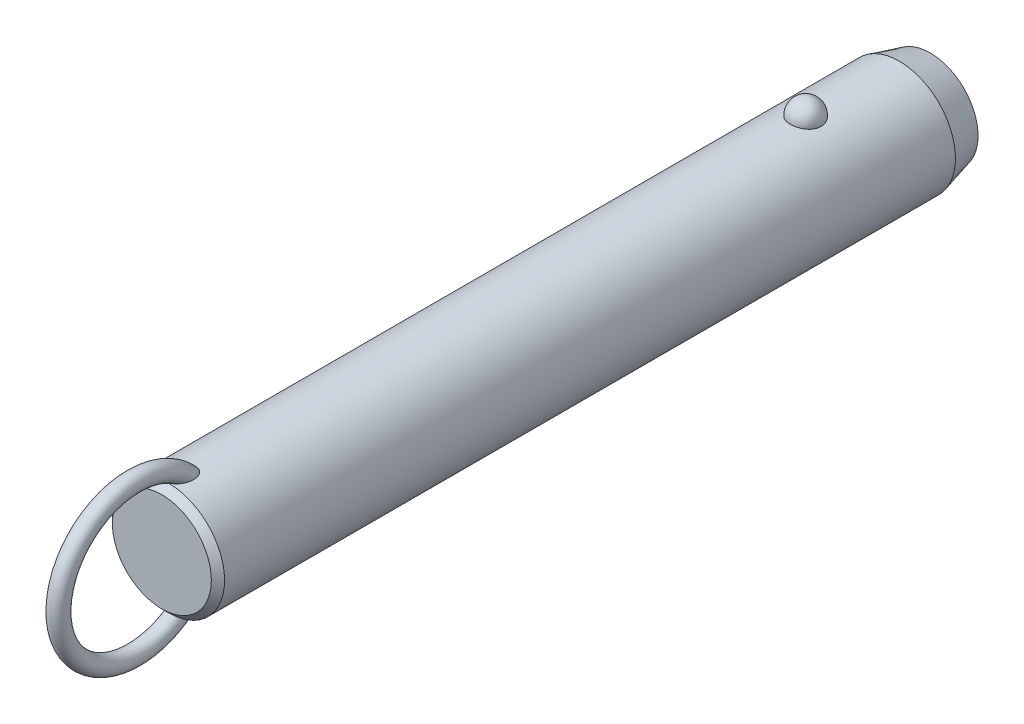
ISO-10303-21;
HEADER;
FILE_DESCRIPTION(('STEP AP214'),'2;1');
FILE_NAME('part.step','',(''),(''),'','','');
FILE_SCHEMA(('AUTOMOTIVE_DESIGN { 1 0 10303 214 1 1 1 1 }'));
ENDSEC;
DATA;
#1=APPLICATION_CONTEXT('core data for automotive mechanical design processes');
#2=APPLICATION_PROTOCOL_DEFINITION('international standard','automotive_design',2000,#1);
#3=PRODUCT_CONTEXT('',#1,'mechanical');
#4=PRODUCT('Part','Part','',(#3));
#5=PRODUCT_RELATED_PRODUCT_CATEGORY('part','',(#4));
#6=PRODUCT_DEFINITION_FORMATION('','',#4);
#7=PRODUCT_DEFINITION_CONTEXT('part definition',#1,'design');
#8=PRODUCT_DEFINITION('design','',#6,#7);
#9=PRODUCT_DEFINITION_SHAPE('','',#8);
#10=(LENGTH_UNIT() NAMED_UNIT(*) SI_UNIT(.MILLI.,.METRE.));
#11=(NAMED_UNIT(*) PLANE_ANGLE_UNIT() SI_UNIT($,.RADIAN.));
#12=(NAMED_UNIT(*) SI_UNIT($,.STERADIAN.) SOLID_ANGLE_UNIT());
#13=UNCERTAINTY_MEASURE_WITH_UNIT(LENGTH_MEASURE(1.E-05),#10,'distance_accuracy_value','');
#14=(GEOMETRIC_REPRESENTATION_CONTEXT(3) GLOBAL_UNCERTAINTY_ASSIGNED_CONTEXT((#13)) GLOBAL_UNIT_ASSIGNED_CONTEXT((#10,
#11,#12)) REPRESENTATION_CONTEXT('',''));
#15=CARTESIAN_POINT('',(0.,0.,0.));
#16=DIRECTION('',(0.,0.,1.));
#17=DIRECTION('',(1.,0.,0.));
#18=AXIS2_PLACEMENT_3D('',#15,#16,#17);
#19=CARTESIAN_POINT('',(0.,0.,129.5));
#20=DIRECTION('',(0.,0.,-1.));
#21=DIRECTION('',(-1.,0.,0.));
#22=AXIS2_PLACEMENT_3D('',#19,#20,#21);
#23=CYLINDRICAL_SURFACE('',#22,12.7);
#24=CARTESIAN_POINT('',(3.46661256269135,12.2177165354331,-3.5));
#25=CARTESIAN_POINT('',(3.4666090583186,12.2177194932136,-3.30432790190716));
#26=CARTESIAN_POINT('',(3.45063567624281,12.2222841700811,-3.10861112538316));
#27=CARTESIAN_POINT('',(3.38712451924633,12.2400345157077,-2.72271899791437));
#28=CARTESIAN_POINT('',(3.33957415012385,12.2532236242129,-2.53254588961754));
#29=CARTESIAN_POINT('',(3.2141234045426,12.286724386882,-2.16324948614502));
#30=CARTESIAN_POINT('',(3.13623639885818,12.3070329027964,-1.98412136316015));
#31=CARTESIAN_POINT('',(2.95205930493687,12.3525018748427,-1.64180592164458));
#32=CARTESIAN_POINT('',(2.84577003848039,12.3776621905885,-1.47861814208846));
#33=CARTESIAN_POINT('',(2.60688050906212,12.4301712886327,-1.17190583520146));
#34=CARTESIAN_POINT('',(2.47415697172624,12.4575299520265,-1.02847897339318));
#35=CARTESIAN_POINT('',(2.18615174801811,12.5112810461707,-0.766177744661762));
#36=CARTESIAN_POINT('',(2.03087002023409,12.5376734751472,-0.64730342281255));
#37=CARTESIAN_POINT('',(1.70237334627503,12.5864761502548,-0.437732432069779));
#38=CARTESIAN_POINT('',(1.52920948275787,12.6088972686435,-0.346958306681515));
#39=CARTESIAN_POINT('',(1.16944170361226,12.6473352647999,-0.195750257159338));
#40=CARTESIAN_POINT('',(0.982839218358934,12.663352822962,-0.135313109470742));
#41=CARTESIAN_POINT('',(0.604961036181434,12.6869706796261,-0.0473241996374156));
#42=CARTESIAN_POINT('',(0.41382314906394,12.6947125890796,-0.0192185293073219));
#43=CARTESIAN_POINT('',(0.0293827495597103,12.7014203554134,0.0051725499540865));
#44=CARTESIAN_POINT('',(-0.163919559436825,12.7003870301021,0.00146092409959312));
#45=CARTESIAN_POINT('',(-0.544374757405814,12.689735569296,-0.0373939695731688));
#46=CARTESIAN_POINT('',(-0.731575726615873,12.6802364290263,-0.0721015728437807));
#47=CARTESIAN_POINT('',(-1.09733277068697,12.6538333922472,-0.171364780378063));
#48=CARTESIAN_POINT('',(-1.27588869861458,12.6369293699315,-0.235920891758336));
#49=CARTESIAN_POINT('',(-1.6204698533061,12.5973946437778,-0.393548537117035));
#50=CARTESIAN_POINT('',(-1.78641865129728,12.5747321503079,-0.486778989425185));
#51=CARTESIAN_POINT('',(-2.10030671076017,12.5261316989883,-0.699110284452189));
#52=CARTESIAN_POINT('',(-2.24824419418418,12.5001934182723,-0.818213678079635));
#53=CARTESIAN_POINT('',(-2.52491489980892,12.4472906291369,-1.08157124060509));
#54=CARTESIAN_POINT('',(-2.65324222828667,12.4203160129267,-1.22624992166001));
#55=CARTESIAN_POINT('',(-2.88410007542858,12.3687509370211,-1.53528325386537));
#56=CARTESIAN_POINT('',(-2.98662883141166,12.3441606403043,-1.69963924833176));
#57=CARTESIAN_POINT('',(-3.16432417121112,12.2998199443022,-2.04548497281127));
#58=CARTESIAN_POINT('',(-3.23917525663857,12.2801261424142,-2.22714424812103));
#59=CARTESIAN_POINT('',(-3.35800573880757,12.248167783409,-2.6009138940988));
#60=CARTESIAN_POINT('',(-3.4019860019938,12.2359030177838,-2.79302397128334));
#61=CARTESIAN_POINT('',(-3.45784812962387,12.2202347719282,-3.18140279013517));
#62=CARTESIAN_POINT('',(-3.46986123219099,12.2167950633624,-3.37765118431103));
#63=CARTESIAN_POINT('',(-3.46186273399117,12.2190638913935,-3.76943689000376));
#64=CARTESIAN_POINT('',(-3.44185196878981,12.2247721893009,-3.96497421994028));
#65=CARTESIAN_POINT('',(-3.37048652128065,12.2446381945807,-4.34881728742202));
#66=CARTESIAN_POINT('',(-3.31928253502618,12.2587552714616,-4.53715319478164));
#67=CARTESIAN_POINT('',(-3.18693461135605,12.2938237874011,-4.90231727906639));
#68=CARTESIAN_POINT('',(-3.1057895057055,12.3147754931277,-5.07914500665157));
#69=CARTESIAN_POINT('',(-2.91506431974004,12.3613125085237,-5.41732059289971));
#70=CARTESIAN_POINT('',(-2.80533587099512,12.3869217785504,-5.57858147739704));
#71=CARTESIAN_POINT('',(-2.560414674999,12.4398525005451,-5.88013283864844));
#72=CARTESIAN_POINT('',(-2.42522099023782,12.4671740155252,-6.02042254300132));
#73=CARTESIAN_POINT('',(-2.1323357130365,12.5205965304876,-6.27662798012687));
#74=CARTESIAN_POINT('',(-1.97456596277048,12.5466928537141,-6.3924554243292));
#75=CARTESIAN_POINT('',(-1.64115839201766,12.5946384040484,-6.59583547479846));
#76=CARTESIAN_POINT('',(-1.46552179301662,12.6164879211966,-6.68339001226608));
#77=CARTESIAN_POINT('',(-1.10356050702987,12.6532533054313,-6.82682153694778));
#78=CARTESIAN_POINT('',(-0.9173913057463,12.6682500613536,-6.8830698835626));
#79=CARTESIAN_POINT('',(-0.537836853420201,12.6900288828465,-6.96386887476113));
#80=CARTESIAN_POINT('',(-0.344452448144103,12.6968119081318,-6.9884232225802));
#81=CARTESIAN_POINT('',(0.0402577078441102,12.7013667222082,-7.00496469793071));
#82=CARTESIAN_POINT('',(0.231556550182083,12.6993008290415,-6.99753844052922));
#83=CARTESIAN_POINT('',(0.610105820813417,12.6867505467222,-6.9516636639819));
#84=CARTESIAN_POINT('',(0.797356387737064,12.6762664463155,-6.913216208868));
#85=CARTESIAN_POINT('',(1.16186657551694,12.6480587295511,-6.80658431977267));
#86=CARTESIAN_POINT('',(1.33915951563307,12.6303611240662,-6.73850666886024));
#87=CARTESIAN_POINT('',(1.67968518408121,12.5896027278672,-6.5745087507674));
#88=CARTESIAN_POINT('',(1.84291705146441,12.5665416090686,-6.47858678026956));
#89=CARTESIAN_POINT('',(2.15340192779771,12.5171072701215,-6.25982455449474));
#90=CARTESIAN_POINT('',(2.30037831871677,12.4906895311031,-6.13660186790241));
#91=CARTESIAN_POINT('',(2.5717412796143,12.4376567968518,-5.86739587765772));
#92=CARTESIAN_POINT('',(2.69612388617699,12.4110417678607,-5.72140858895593));
#93=CARTESIAN_POINT('',(2.92107785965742,12.360051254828,-5.40794137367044));
#94=CARTESIAN_POINT('',(3.02121329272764,12.3357209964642,-5.24014110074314));
#95=CARTESIAN_POINT('',(3.19236291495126,12.2925446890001,-4.88969865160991));
#96=CARTESIAN_POINT('',(3.26338839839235,12.2736965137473,-4.70706226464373));
#97=CARTESIAN_POINT('',(3.36788038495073,12.245404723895,-4.35469510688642));
#98=CARTESIAN_POINT('',(3.40484026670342,12.2351018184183,-4.18605935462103));
#99=CARTESIAN_POINT('',(3.45420764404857,12.2212564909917,-3.84496058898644));
#100=CARTESIAN_POINT('',(3.46661565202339,12.2177139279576,-3.67249765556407));
#101=CARTESIAN_POINT('',(3.46661256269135,12.2177165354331,-3.5));
#102=B_SPLINE_CURVE_WITH_KNOTS('',3,(#24,#25,#26,#27,#28,#29,#30,#31,#32,#33,#34,#35,#36,#37,
#38,#39,#40,#41,#42,#43,#44,#45,#46,#47,#48,#49,#50,#51,#52,#53,#54,#55,#56,#57,#58,#59,#60,#61,
#62,#63,#64,#65,#66,#67,#68,#69,#70,#71,#72,#73,#74,#75,#76,#77,#78,#79,#80,#81,#82,#83,#84,#85,
#86,#87,#88,#89,#90,#91,#92,#93,#94,#95,#96,#97,#98,#99,#100,#101),.UNSPECIFIED.,.T.,.F.,(4,2,2,
2,2,2,2,2,2,2,2,2,2,2,2,2,2,2,2,2,2,2,2,2,2,2,2,2,2,2,2,2,2,2,2,2,2,2,4),(0.,0.586396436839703,
1.17302689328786,1.7593990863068,2.34575431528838,2.93491084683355,3.52406845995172,
4.11158733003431,4.69904375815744,5.2762784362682,5.85345931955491,6.42265312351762,
6.99185659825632,7.56427334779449,8.136746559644,8.71981013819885,9.3029135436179,
9.89247258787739,10.4820150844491,11.0691335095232,11.6562366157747,12.2405256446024,
12.8248374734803,13.412244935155,13.9996740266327,14.5891883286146,15.1786623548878,
15.7609861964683,16.3432419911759,16.9148635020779,17.4864654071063,18.0560241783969,
18.6256177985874,19.2037609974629,19.7820055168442,20.3699810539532,20.957728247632,
21.4746855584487,21.9916320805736),.UNSPECIFIED.);
#103=CARTESIAN_POINT('',(3.46661256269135,12.2177165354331,-3.5));
#104=VERTEX_POINT('',#103);
#105=EDGE_CURVE('E41',#104,#104,#102,.T.);
#106=ORIENTED_EDGE('',*,*,#105,.T.);
#107=EDGE_LOOP('',(#106));
#108=FACE_BOUND('',#107,.T.);
#109=CARTESIAN_POINT('',(0.,0.,140.7));
#110=DIRECTION('',(0.,0.,1.));
#111=DIRECTION('',(1.,0.,0.));
#112=AXIS2_PLACEMENT_3D('',#109,#110,#111);
#113=CIRCLE('',#112,12.7);
#114=CARTESIAN_POINT('',(12.7,0.,140.7));
#115=VERTEX_POINT('',#114);
#116=EDGE_CURVE('E10',#115,#115,#113,.F.);
#117=ORIENTED_EDGE('',*,*,#116,.T.);
#118=EDGE_LOOP('',(#117));
#119=FACE_BOUND('',#118,.T.);
#120=CARTESIAN_POINT('',(-0.548122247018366,-12.6881662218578,134.443218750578));
#121=CARTESIAN_POINT('',(-0.648865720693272,-12.6838128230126,134.477926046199));
#122=CARTESIAN_POINT('',(-0.746398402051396,-12.6783867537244,134.522042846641));
#123=CARTESIAN_POINT('',(-0.932125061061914,-12.666091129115,134.626764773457));
#124=CARTESIAN_POINT('',(-1.02030388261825,-12.6592192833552,134.687396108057));
#125=CARTESIAN_POINT('',(-1.18487740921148,-12.6448747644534,134.821847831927));
#126=CARTESIAN_POINT('',(-1.26134296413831,-12.637406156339,134.895582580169));
#127=CARTESIAN_POINT('',(-1.4023120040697,-12.6225412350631,135.053604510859));
#128=CARTESIAN_POINT('',(-1.466814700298,-12.6151449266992,135.13789238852));
#129=CARTESIAN_POINT('',(-1.60714786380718,-12.5981718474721,135.349657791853));
#130=CARTESIAN_POINT('',(-1.67725126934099,-12.588900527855,135.480962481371));
#131=CARTESIAN_POINT('',(-1.79536591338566,-12.5725964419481,135.753247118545));
#132=CARTESIAN_POINT('',(-1.84333535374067,-12.5655679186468,135.894244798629));
#133=CARTESIAN_POINT('',(-1.93422576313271,-12.5519624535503,136.237645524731));
#134=CARTESIAN_POINT('',(-1.96788773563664,-12.5466298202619,136.442557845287));
#135=CARTESIAN_POINT('',(-1.9941399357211,-12.542463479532,136.751760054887));
#136=CARTESIAN_POINT('',(-1.99883864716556,-12.5417153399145,136.855298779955));
#137=CARTESIAN_POINT('',(-2.00078003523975,-12.5414074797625,137.06245124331));
#138=CARTESIAN_POINT('',(-1.99802449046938,-12.5418474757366,137.166064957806));
#139=CARTESIAN_POINT('',(-1.98336733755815,-12.5441750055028,137.41032076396));
#140=CARTESIAN_POINT('',(-1.96851430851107,-12.5465291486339,137.550780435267));
#141=CARTESIAN_POINT('',(-1.92707089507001,-12.5529612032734,137.829960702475));
#142=CARTESIAN_POINT('',(-1.90047458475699,-12.5570399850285,137.968680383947));
#143=CARTESIAN_POINT('',(-1.8361912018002,-12.5666008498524,138.24341135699));
#144=CARTESIAN_POINT('',(-1.79850828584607,-12.57208240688,138.379423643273));
#145=CARTESIAN_POINT('',(-1.71223796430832,-12.5841228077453,138.647842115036));
#146=CARTESIAN_POINT('',(-1.66365679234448,-12.5906810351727,138.780250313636));
#147=CARTESIAN_POINT('',(-1.5780450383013,-12.6016176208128,138.98548877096));
#148=CARTESIAN_POINT('',(-1.54477252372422,-12.6057501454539,139.059914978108));
#149=CARTESIAN_POINT('',(-1.47424480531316,-12.6141930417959,139.206839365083));
#150=CARTESIAN_POINT('',(-1.436990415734,-12.6185033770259,139.279337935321));
#151=CARTESIAN_POINT('',(-1.35825795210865,-12.6272207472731,139.421892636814));
#152=CARTESIAN_POINT('',(-1.31678520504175,-12.6316276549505,139.491951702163));
#153=CARTESIAN_POINT('',(-1.22917793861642,-12.6404532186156,139.629070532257));
#154=CARTESIAN_POINT('',(-1.18304514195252,-12.6448718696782,139.696131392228));
#155=CARTESIAN_POINT('',(-1.07246411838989,-12.6547893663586,139.843874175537));
#156=CARTESIAN_POINT('',(-1.00642239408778,-12.6602600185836,139.923384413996));
#157=CARTESIAN_POINT('',(-0.86444142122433,-12.6707460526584,140.073169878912));
#158=CARTESIAN_POINT('',(-0.788516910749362,-12.6757620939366,140.143458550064));
#159=CARTESIAN_POINT('',(-0.652215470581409,-12.6833591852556,140.248680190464));
#160=CARTESIAN_POINT('',(-0.59498203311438,-12.6861973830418,140.287624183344));
#161=CARTESIAN_POINT('',(-0.475269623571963,-12.6912445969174,140.356489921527));
#162=CARTESIAN_POINT('',(-0.412800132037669,-12.6934547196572,140.386427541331));
#163=CARTESIAN_POINT('',(-0.295749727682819,-12.6966636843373,140.42975652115));
#164=CARTESIAN_POINT('',(-0.241949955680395,-12.6978134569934,140.445218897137));
#165=CARTESIAN_POINT('',(-0.132508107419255,-12.6994261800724,140.466884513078));
#166=CARTESIAN_POINT('',(-0.0768679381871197,-12.6998898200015,140.473097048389));
#167=CARTESIAN_POINT('',(0.03476966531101,-12.7000752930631,140.475583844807));
#168=CARTESIAN_POINT('',(0.0907676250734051,-12.6997954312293,140.471835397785));
#169=CARTESIAN_POINT('',(0.201283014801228,-12.6985255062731,140.454788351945));
#170=CARTESIAN_POINT('',(0.255799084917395,-12.6975348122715,140.441481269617));
#171=CARTESIAN_POINT('',(0.376042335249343,-12.6946091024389,140.40203792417));
#172=CARTESIAN_POINT('',(0.440950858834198,-12.6924943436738,140.373449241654));
#173=CARTESIAN_POINT('',(0.565350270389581,-12.6875639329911,140.306323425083));
#174=CARTESIAN_POINT('',(0.624828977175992,-12.6847467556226,140.267764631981));
#175=CARTESIAN_POINT('',(0.774116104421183,-12.6767252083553,140.156949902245));
#176=CARTESIAN_POINT('',(0.859449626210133,-12.6711344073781,140.078760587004));
#177=CARTESIAN_POINT('',(1.01789440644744,-12.6593922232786,139.910943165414));
#178=CARTESIAN_POINT('',(1.09096902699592,-12.653239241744,139.821282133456));
#179=CARTESIAN_POINT('',(1.22268793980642,-12.6411674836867,139.640265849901));
#180=CARTESIAN_POINT('',(1.28193986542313,-12.6352572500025,139.549345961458));
#181=CARTESIAN_POINT('',(1.39259777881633,-12.6235401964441,139.362792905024));
#182=CARTESIAN_POINT('',(1.44399707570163,-12.6177334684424,139.267155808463));
#183=CARTESIAN_POINT('',(1.53972870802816,-12.6064093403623,139.072273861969));
#184=CARTESIAN_POINT('',(1.58405262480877,-12.6008922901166,138.973024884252));
#185=CARTESIAN_POINT('',(1.66600705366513,-12.5903187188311,138.771772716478));
#186=CARTESIAN_POINT('',(1.70363651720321,-12.5852622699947,138.669769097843));
#187=CARTESIAN_POINT('',(1.77545379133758,-12.5753406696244,138.454358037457));
#188=CARTESIAN_POINT('',(1.80903453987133,-12.5705328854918,138.340745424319));
#189=CARTESIAN_POINT('',(1.86844163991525,-12.5618400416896,138.111457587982));
#190=CARTESIAN_POINT('',(1.89426665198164,-12.5579551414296,137.995782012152));
#191=CARTESIAN_POINT('',(1.9378546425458,-12.5513030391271,137.763007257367));
#192=CARTESIAN_POINT('',(1.95562640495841,-12.5485346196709,137.645909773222));
#193=CARTESIAN_POINT('',(1.98264463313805,-12.5442934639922,137.410747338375));
#194=CARTESIAN_POINT('',(1.99189298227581,-12.5428204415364,137.29268260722));
#195=CARTESIAN_POINT('',(2.00416068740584,-12.540871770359,136.980622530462));
#196=CARTESIAN_POINT('',(1.99944433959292,-12.541631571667,136.786229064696));
#197=CARTESIAN_POINT('',(1.96113755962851,-12.5476846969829,136.400309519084));
#198=CARTESIAN_POINT('',(1.92758341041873,-12.5529723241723,136.208780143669));
#199=CARTESIAN_POINT('',(1.83934342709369,-12.5661532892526,135.882272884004));
#200=CARTESIAN_POINT('',(1.79215440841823,-12.5730485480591,135.74524997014));
#201=CARTESIAN_POINT('',(1.67676242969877,-12.588958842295,135.480445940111));
#202=CARTESIAN_POINT('',(1.60859050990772,-12.597970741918,135.352651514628));
#203=CARTESIAN_POINT('',(1.46583832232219,-12.6152829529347,135.135800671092));
#204=CARTESIAN_POINT('',(1.39525727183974,-12.6233659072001,135.04410500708));
#205=CARTESIAN_POINT('',(1.23992594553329,-12.6395676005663,134.873485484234));
#206=CARTESIAN_POINT('',(1.15517932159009,-12.6476863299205,134.794558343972));
#207=CARTESIAN_POINT('',(0.971995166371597,-12.6630846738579,134.652643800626));
#208=CARTESIAN_POINT('',(0.873456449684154,-12.6703572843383,134.589784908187));
#209=CARTESIAN_POINT('',(0.665847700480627,-12.6829569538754,134.484487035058));
#210=CARTESIAN_POINT('',(0.556784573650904,-12.688285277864,134.442034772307));
#211=CARTESIAN_POINT('',(0.347338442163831,-12.6956226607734,134.384443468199));
#212=CARTESIAN_POINT('',(0.247759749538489,-12.6979816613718,134.366399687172));
#213=CARTESIAN_POINT('',(0.0470218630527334,-12.7003077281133,134.348600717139));
#214=CARTESIAN_POINT('',(-0.0541350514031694,-12.7002779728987,134.348821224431));
#215=CARTESIAN_POINT('',(-0.221414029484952,-12.6982482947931,134.364363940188));
#216=CARTESIAN_POINT('',(-0.288055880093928,-12.6969033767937,134.374666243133));
#217=CARTESIAN_POINT('',(-0.419599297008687,-12.6932369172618,134.40313489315));
#218=CARTESIAN_POINT('',(-0.484501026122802,-12.6909154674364,134.421300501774));
#219=CARTESIAN_POINT('',(-0.548122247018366,-12.6881662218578,134.443218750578));
#220=B_SPLINE_CURVE_WITH_KNOTS('',3,(#120,#121,#122,#123,#124,#125,#126,#127,#128,#129,#130,
#131,#132,#133,#134,#135,#136,#137,#138,#139,#140,#141,#142,#143,#144,#145,#146,#147,#148,#149,
#150,#151,#152,#153,#154,#155,#156,#157,#158,#159,#160,#161,#162,#163,#164,#165,#166,#167,#168,
#169,#170,#171,#172,#173,#174,#175,#176,#177,#178,#179,#180,#181,#182,#183,#184,#185,#186,#187,
#188,#189,#190,#191,#192,#193,#194,#195,#196,#197,#198,#199,#200,#201,#202,#203,#204,#205,#206,
#207,#208,#209,#210,#211,#212,#213,#214,#215,#216,#217,#218,#219),.UNSPECIFIED.,.T.,.F.,(4,2,2,
2,2,2,2,2,2,2,2,2,2,2,2,2,2,2,2,2,2,2,2,2,2,2,2,2,2,2,2,2,2,2,2,2,2,2,2,2,2,2,2,2,2,2,2,2,2,4),
(0.,0.31964225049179,0.639794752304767,0.957927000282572,1.27608021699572,1.72100165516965,
2.16675988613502,2.78630021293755,3.09705782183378,3.40774128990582,3.83096358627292,
4.25439969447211,4.67767724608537,5.10071330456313,5.34550297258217,5.59024267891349,
5.83467707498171,6.07902143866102,6.38891080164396,6.69834321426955,6.9056091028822,
7.11250749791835,7.27977315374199,7.44687060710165,7.61434932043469,7.78197685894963,
7.99365544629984,8.20579780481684,8.55147335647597,8.89816429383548,9.22375138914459,
9.54961437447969,9.8758622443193,10.202161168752,10.557587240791,10.9130746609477,
11.2681734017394,11.6231936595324,12.2046601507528,12.7853961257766,13.219164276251,
13.6522938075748,13.9989174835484,14.3454519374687,14.6946768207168,15.0436740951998,
15.3457513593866,15.6474266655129,15.8493051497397,16.0511646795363),.UNSPECIFIED.);
#221=CARTESIAN_POINT('',(-0.548122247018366,-12.6881662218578,134.443218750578));
#222=VERTEX_POINT('',#221);
#223=EDGE_CURVE('E60',#222,#222,#220,.T.);
#224=ORIENTED_EDGE('',*,*,#223,.T.);
#225=EDGE_LOOP('',(#224));
#226=FACE_BOUND('',#225,.T.);
#227=CARTESIAN_POINT('',(-0.548122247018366,12.6881662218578,134.443218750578));
#228=CARTESIAN_POINT('',(-0.459436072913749,12.6919968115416,134.412673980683));
#229=CARTESIAN_POINT('',(-0.368189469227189,12.6949996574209,134.389391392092));
#230=CARTESIAN_POINT('',(-0.18302400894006,12.6990186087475,134.358406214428));
#231=CARTESIAN_POINT('',(-0.0891049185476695,12.7000345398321,134.350704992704));
#232=CARTESIAN_POINT('',(0.0987147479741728,12.6999636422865,134.351245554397));
#233=CARTESIAN_POINT('',(0.192615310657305,12.6988761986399,134.359492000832));
#234=CARTESIAN_POINT('',(0.377658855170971,12.6947211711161,134.391551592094));
#235=CARTESIAN_POINT('',(0.468801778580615,12.6916535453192,134.415365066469));
#236=CARTESIAN_POINT('',(0.645809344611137,12.6838788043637,134.47745651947));
#237=CARTESIAN_POINT('',(0.731679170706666,12.6791733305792,134.515720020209));
#238=CARTESIAN_POINT('',(0.896315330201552,12.6686004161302,134.605120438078));
#239=CARTESIAN_POINT('',(0.975080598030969,12.6627328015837,134.656259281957));
#240=CARTESIAN_POINT('',(1.12963655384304,12.6499161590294,134.77367820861));
#241=CARTESIAN_POINT('',(1.20478673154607,12.6429194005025,134.840792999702));
#242=CARTESIAN_POINT('',(1.34448241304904,12.6288282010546,134.98522507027));
#243=CARTESIAN_POINT('',(1.40902173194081,12.621733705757,135.062548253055));
#244=CARTESIAN_POINT('',(1.55208211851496,12.6050877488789,135.259247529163));
#245=CARTESIAN_POINT('',(1.62510490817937,12.5957546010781,135.382654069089));
#246=CARTESIAN_POINT('',(1.7501904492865,12.5789823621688,135.639769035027));
#247=CARTESIAN_POINT('',(1.80221377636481,12.5715468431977,135.773496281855));
#248=CARTESIAN_POINT('',(1.90309965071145,12.5567434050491,136.098351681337));
#249=CARTESIAN_POINT('',(1.94342317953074,12.5504515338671,136.292161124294));
#250=CARTESIAN_POINT('',(1.99332997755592,12.5426147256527,136.68378810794));
#251=CARTESIAN_POINT('',(2.00285305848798,12.5410790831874,136.881612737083));
#252=CARTESIAN_POINT('',(1.99678999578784,12.5420407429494,137.216642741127));
#253=CARTESIAN_POINT('',(1.98794117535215,12.5434564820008,137.354042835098));
#254=CARTESIAN_POINT('',(1.95865119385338,12.5480641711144,137.627639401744));
#255=CARTESIAN_POINT('',(1.93820436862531,12.5512569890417,137.763835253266));
#256=CARTESIAN_POINT('',(1.88647896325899,12.5591352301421,138.034249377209));
#257=CARTESIAN_POINT('',(1.85518800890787,12.5638223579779,138.168465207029));
#258=CARTESIAN_POINT('',(1.78217886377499,12.5743868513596,138.433936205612));
#259=CARTESIAN_POINT('',(1.74046509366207,12.5802637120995,138.565192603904));
#260=CARTESIAN_POINT('',(1.66024095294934,12.5910571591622,138.786085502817));
#261=CARTESIAN_POINT('',(1.62434772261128,12.5957535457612,138.876690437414));
#262=CARTESIAN_POINT('',(1.54709009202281,12.6054762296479,139.055512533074));
#263=CARTESIAN_POINT('',(1.50572681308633,12.6105024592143,139.143730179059));
#264=CARTESIAN_POINT('',(1.41728020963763,12.620748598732,139.316932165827));
#265=CARTESIAN_POINT('',(1.37021377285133,12.625967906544,139.401925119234));
#266=CARTESIAN_POINT('',(1.26969620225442,12.6364721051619,139.568007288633));
#267=CARTESIAN_POINT('',(1.21624929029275,12.6417569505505,139.649099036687));
#268=CARTESIAN_POINT('',(1.10304413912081,12.6521331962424,139.804702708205));
#269=CARTESIAN_POINT('',(1.04340936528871,12.657226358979,139.879303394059));
#270=CARTESIAN_POINT('',(0.915919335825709,12.667090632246,140.021324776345));
#271=CARTESIAN_POINT('',(0.848064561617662,12.6718617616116,140.08874589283));
#272=CARTESIAN_POINT('',(0.717035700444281,12.67987711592,140.200624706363));
#273=CARTESIAN_POINT('',(0.655526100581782,12.6832377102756,140.246997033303));
#274=CARTESIAN_POINT('',(0.525985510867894,12.6892676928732,140.329619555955));
#275=CARTESIAN_POINT('',(0.457969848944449,12.6919386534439,140.365892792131));
#276=CARTESIAN_POINT('',(0.334859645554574,12.695691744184,140.416657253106));
#277=CARTESIAN_POINT('',(0.281116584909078,12.6970073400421,140.434373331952));
#278=CARTESIAN_POINT('',(0.171425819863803,12.6989609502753,140.460642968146));
#279=CARTESIAN_POINT('',(0.115480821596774,12.699599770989,140.469207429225));
#280=CARTESIAN_POINT('',(0.00272618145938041,12.7001251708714,140.476253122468));
#281=CARTESIAN_POINT('',(-0.0540859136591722,12.7000089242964,140.474696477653));
#282=CARTESIAN_POINT('',(-0.16654462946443,12.6990328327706,140.461600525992));
#283=CARTESIAN_POINT('',(-0.222190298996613,12.6981724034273,140.450053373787));
#284=CARTESIAN_POINT('',(-0.342018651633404,12.695562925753,140.414912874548));
#285=CARTESIAN_POINT('',(-0.405606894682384,12.6936676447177,140.38933225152));
#286=CARTESIAN_POINT('',(-0.527815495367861,12.6891754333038,140.328311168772));
#287=CARTESIAN_POINT('',(-0.586425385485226,12.6865770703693,140.292850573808));
#288=CARTESIAN_POINT('',(-0.731842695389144,12.6792129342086,140.191496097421));
#289=CARTESIAN_POINT('',(-0.81470941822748,12.6740767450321,140.1200395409));
#290=CARTESIAN_POINT('',(-0.969101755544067,12.6632083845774,139.96589007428));
#291=CARTESIAN_POINT('',(-1.04059564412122,12.6574746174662,139.883166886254));
#292=CARTESIAN_POINT('',(-1.16981116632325,12.6461638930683,139.715809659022));
#293=CARTESIAN_POINT('',(-1.22811369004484,12.6405994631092,139.631616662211));
#294=CARTESIAN_POINT('',(-1.33743405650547,12.6295007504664,139.458579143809));
#295=CARTESIAN_POINT('',(-1.38844577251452,12.6239664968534,139.369730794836));
#296=CARTESIAN_POINT('',(-1.48400702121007,12.6130898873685,139.188389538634));
#297=CARTESIAN_POINT('',(-1.52854232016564,12.6077479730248,139.095889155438));
#298=CARTESIAN_POINT('',(-1.61150113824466,12.5974127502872,138.908160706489));
#299=CARTESIAN_POINT('',(-1.64992317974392,12.5924195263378,138.812931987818));
#300=CARTESIAN_POINT('',(-1.73468589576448,12.581070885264,138.58289362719));
#301=CARTESIAN_POINT('',(-1.77831261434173,12.5749388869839,138.447066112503));
#302=CARTESIAN_POINT('',(-1.85439734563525,12.5639437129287,138.172212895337));
#303=CARTESIAN_POINT('',(-1.88684994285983,12.5590811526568,138.033185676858));
#304=CARTESIAN_POINT('',(-1.94008483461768,12.550968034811,137.75309235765));
#305=CARTESIAN_POINT('',(-1.96088706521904,12.5477147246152,137.612030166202));
#306=CARTESIAN_POINT('',(-1.99000539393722,12.5431291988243,137.328668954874));
#307=CARTESIAN_POINT('',(-1.99832911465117,12.5417958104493,137.186370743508));
#308=CARTESIAN_POINT('',(-2.00166624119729,12.5412674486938,136.857627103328));
#309=CARTESIAN_POINT('',(-1.99178843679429,12.5428579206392,136.671088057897));
#310=CARTESIAN_POINT('',(-1.94455183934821,12.5502731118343,136.30162404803));
#311=CARTESIAN_POINT('',(-1.90724032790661,12.5560905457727,136.118693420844));
#312=CARTESIAN_POINT('',(-1.81330718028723,12.5699462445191,135.804848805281));
#313=CARTESIAN_POINT('',(-1.76338820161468,12.5771273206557,135.671910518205));
#314=CARTESIAN_POINT('',(-1.64305018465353,12.593414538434,135.415681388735));
#315=CARTESIAN_POINT('',(-1.57265346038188,12.6025185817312,135.292380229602));
#316=CARTESIAN_POINT('',(-1.42634956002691,12.6198178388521,135.083564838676));
#317=CARTESIAN_POINT('',(-1.35423772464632,12.6278405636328,134.995384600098));
#318=CARTESIAN_POINT('',(-1.19645664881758,12.6437632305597,134.832107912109));
#319=CARTESIAN_POINT('',(-1.1108053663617,12.6516633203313,134.756994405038));
#320=CARTESIAN_POINT('',(-0.947219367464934,12.6648319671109,134.637811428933));
#321=CARTESIAN_POINT('',(-0.871624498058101,12.670300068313,134.590541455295));
#322=CARTESIAN_POINT('',(-0.714161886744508,12.6801492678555,134.5077413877));
#323=CARTESIAN_POINT('',(-0.632295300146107,12.684530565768,134.47220913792));
#324=CARTESIAN_POINT('',(-0.548122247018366,12.6881662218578,134.443218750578));
#325=B_SPLINE_CURVE_WITH_KNOTS('',3,(#227,#228,#229,#230,#231,#232,#233,#234,#235,#236,#237,
#238,#239,#240,#241,#242,#243,#244,#245,#246,#247,#248,#249,#250,#251,#252,#253,#254,#255,#256,
#257,#258,#259,#260,#261,#262,#263,#264,#265,#266,#267,#268,#269,#270,#271,#272,#273,#274,#275,
#276,#277,#278,#279,#280,#281,#282,#283,#284,#285,#286,#287,#288,#289,#290,#291,#292,#293,#294,
#295,#296,#297,#298,#299,#300,#301,#302,#303,#304,#305,#306,#307,#308,#309,#310,#311,#312,#313,
#314,#315,#316,#317,#318,#319,#320,#321,#322,#323,#324),.UNSPECIFIED.,.T.,.F.,(4,2,2,2,2,2,2,2,
2,2,2,2,2,2,2,2,2,2,2,2,2,2,2,2,2,2,2,2,2,2,2,2,2,2,2,2,2,2,2,2,2,2,2,2,2,2,2,2,4),(0.,
0.281328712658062,0.562682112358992,0.844117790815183,1.12555942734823,1.40671982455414,
1.68792232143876,1.98972294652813,2.29169886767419,2.72039860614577,3.14989948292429,
3.74084916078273,4.33295293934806,4.74554109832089,5.15833092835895,5.57159335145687,
5.98468079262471,6.27722775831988,6.56971484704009,6.86135609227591,7.15280542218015,
7.43927407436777,7.72572595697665,7.95635862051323,8.18646071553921,8.35559393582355,
8.52452541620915,8.69408946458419,8.86378678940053,9.06834348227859,9.27332014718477,
9.60010414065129,9.92778432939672,10.2350252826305,10.5425229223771,10.8506864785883,
11.15892440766,11.5867893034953,12.0148612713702,12.4421984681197,12.8692745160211,
13.4279365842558,13.9856380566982,14.4107062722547,14.835313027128,15.1765567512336,
15.517351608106,15.7844129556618,16.051425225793),.UNSPECIFIED.);
#326=CARTESIAN_POINT('',(-0.548122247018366,12.6881662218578,134.443218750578));
#327=VERTEX_POINT('',#326);
#328=EDGE_CURVE('E67',#327,#327,#325,.T.);
#329=ORIENTED_EDGE('',*,*,#328,.T.);
#330=EDGE_LOOP('',(#329));
#331=FACE_BOUND('',#330,.T.);
#332=CARTESIAN_POINT('',(0.,0.,-24.6999999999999));
#333=DIRECTION('',(0.,0.,-1.));
#334=DIRECTION('',(-1.,0.,0.));
#335=AXIS2_PLACEMENT_3D('',#332,#333,#334);
#336=CIRCLE('',#335,12.7);
#337=CARTESIAN_POINT('',(-12.7,0.,-24.6999999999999));
#338=VERTEX_POINT('',#337);
#339=EDGE_CURVE('E57',#338,#338,#336,.F.);
#340=ORIENTED_EDGE('',*,*,#339,.T.);
#341=EDGE_LOOP('',(#340));
#342=FACE_BOUND('',#341,.T.);
#343=ADVANCED_FACE('F37',(#108,#119,#226,#331,#342),#23,.T.);
#344=CARTESIAN_POINT('',(0.,0.,-31.7));
#345=DIRECTION('',(0.,0.,-1.));
#346=DIRECTION('',(-1.,0.,0.));
#347=AXIS2_PLACEMENT_3D('',#344,#345,#346);
#348=PLANE('',#347);
#349=CARTESIAN_POINT('',(0.,0.,-31.7));
#350=DIRECTION('',(0.,0.,-1.));
#351=DIRECTION('',(-1.,0.,0.));
#352=AXIS2_PLACEMENT_3D('',#349,#350,#351);
#353=CIRCLE('',#352,10.8243556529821);
#354=CARTESIAN_POINT('',(-10.8243556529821,0.,-31.7));
#355=VERTEX_POINT('',#354);
#356=EDGE_CURVE('E66',#355,#355,#353,.T.);
#357=ORIENTED_EDGE('',*,*,#356,.T.);
#358=EDGE_LOOP('',(#357));
#359=FACE_BOUND('',#358,.T.);
#360=ADVANCED_FACE('F85',(#359),#348,.T.);
#361=CARTESIAN_POINT('',(0.,0.,-31.7));
#362=DIRECTION('',(0.,0.,1.));
#363=DIRECTION('',(1.,0.,0.));
#364=AXIS2_PLACEMENT_3D('',#361,#362,#363);
#365=CONICAL_SURFACE('',#364,10.8243556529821,0.261799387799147);
#366=ORIENTED_EDGE('',*,*,#339,.F.);
#367=EDGE_LOOP('',(#366));
#368=FACE_BOUND('',#367,.T.);
#369=ORIENTED_EDGE('',*,*,#356,.F.);
#370=EDGE_LOOP('',(#369));
#371=FACE_BOUND('',#370,.T.);
#372=ADVANCED_FACE('F83',(#368,#371),#365,.T.);
#373=CARTESIAN_POINT('',(0.,0.,142.2));
#374=DIRECTION('',(0.,0.,1.));
#375=DIRECTION('',(1.,0.,0.));
#376=AXIS2_PLACEMENT_3D('',#373,#374,#375);
#377=PLANE('',#376);
#378=CARTESIAN_POINT('',(0.,0.,142.2));
#379=DIRECTION('',(0.,0.,1.));
#380=DIRECTION('',(1.,0.,0.));
#381=AXIS2_PLACEMENT_3D('',#378,#379,#380);
#382=CIRCLE('',#381,11.2);
#383=CARTESIAN_POINT('',(11.2,0.,142.2));
#384=VERTEX_POINT('',#383);
#385=EDGE_CURVE('E50',#384,#384,#382,.T.);
#386=ORIENTED_EDGE('',*,*,#385,.T.);
#387=EDGE_LOOP('',(#386));
#388=FACE_BOUND('',#387,.T.);
#389=ADVANCED_FACE('F77',(#388),#377,.T.);
#390=CARTESIAN_POINT('',(0.,0.,148.55));
#391=DIRECTION('',(1.,0.,0.));
#392=DIRECTION('',(0.,0.,-1.));
#393=AXIS2_PLACEMENT_3D('',#390,#391,#392);
#394=TOROIDAL_SURFACE('',#393,17.05,2.);
#395=ORIENTED_EDGE('',*,*,#328,.F.);
#396=EDGE_LOOP('',(#395));
#397=FACE_BOUND('',#396,.T.);
#398=ORIENTED_EDGE('',*,*,#223,.F.);
#399=EDGE_LOOP('',(#398));
#400=FACE_BOUND('',#399,.T.);
#401=ADVANCED_FACE('F73',(#397,#400),#394,.T.);
#402=CARTESIAN_POINT('',(0.,0.,142.2));
#403=DIRECTION('',(0.,0.,-1.));
#404=DIRECTION('',(-1.,0.,0.));
#405=AXIS2_PLACEMENT_3D('',#402,#403,#404);
#406=CONICAL_SURFACE('',#405,11.2,0.785398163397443);
#407=ORIENTED_EDGE('',*,*,#116,.F.);
#408=EDGE_LOOP('',(#407));
#409=FACE_BOUND('',#408,.T.);
#410=ORIENTED_EDGE('',*,*,#385,.F.);
#411=EDGE_LOOP('',(#410));
#412=FACE_BOUND('',#411,.T.);
#413=ADVANCED_FACE('F39',(#409,#412),#406,.T.);
#414=CARTESIAN_POINT('',(0.,12.7,-3.5));
#415=DIRECTION('',(0.,1.,0.));
#416=DIRECTION('',(0.,0.,-1.));
#417=AXIS2_PLACEMENT_3D('',#414,#415,#416);
#418=SPHERICAL_SURFACE('',#417,3.5);
#419=ORIENTED_EDGE('',*,*,#105,.F.);
#420=EDGE_LOOP('',(#419));
#421=FACE_BOUND('',#420,.T.);
#422=ADVANCED_FACE('F79',(#421),#418,.T.);
#423=CLOSED_SHELL('',(#343,#360,#372,#389,#401,#413,#422));
#424=MANIFOLD_SOLID_BREP('B2',#423);
#425=ADVANCED_BREP_SHAPE_REPRESENTATION('',(#18,#424),#14);
#426=SHAPE_DEFINITION_REPRESENTATION(#9,#425);
ENDSEC;
END-ISO-10303-21;
